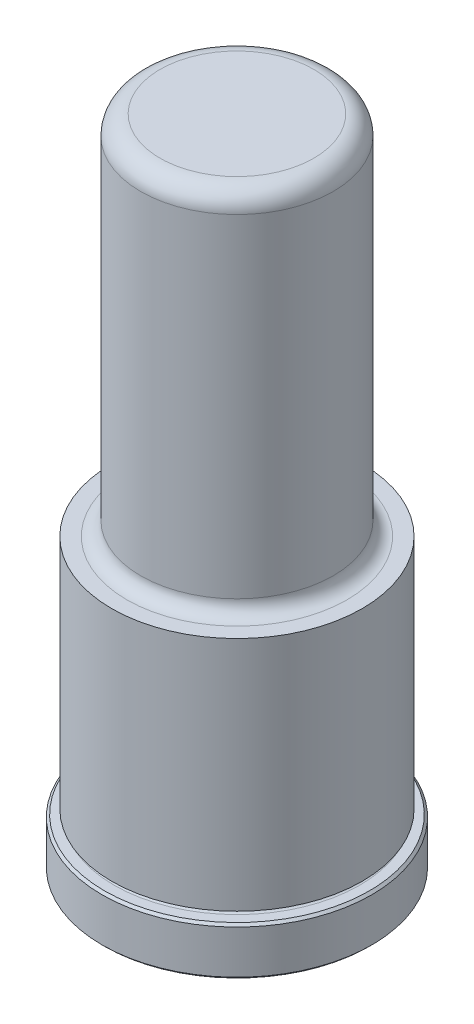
from build123d import *

# Parameters (mm, degrees)
CHAMFER1_SIZE = 0.381
FILLET7_R     = 3.175


with BuildPart() as part:
    # Sketch1 → Revolve1 (revolve)
    with BuildSketch(Plane(origin=(0, 0, 0), x_dir=(0, 0, -1), z_dir=(1, 0, 0)), mode=Mode.PRIVATE) as revolve1_sk:
        with BuildLine():
            Line((0, 0), (22.225, 0))
            Line((22.225, 0), (22.225, 7.9248))
            Line((22.225, 7.9248), (20.2438, 7.9248))
            ThreePointArc((20.2438, 7.9248), (19.8628, 8.3058), (20.2438, 8.6868))
            Line((20.2438, 8.6868), (20.6502, 8.6868))
            Line((20.6502, 8.6868), (20.6502, 47.625))
            Line((20.6502, 47.625), (18.1483, 47.625))
            ThreePointArc((18.1483, 47.625), (16.531853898, 48.294553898), (15.8623, 49.911))
            Line((15.8623, 49.911), (15.8623, 107.95))
            Line((15.8623, 107.95), (0, 107.95))
            Line((0, 107.95), (0, 0))
        make_face()
    revolve(revolve1_sk.sketch.rotate(Axis((0, 0, 0), (0, -1, 0)), 180), axis=Axis((0, 0, 0), (0, -1, 0)))

    # Chamfer1
    chamfer1_edges = [part.edges().sort_by_distance(p)[0] for p in [
        (0, 7.9248, -22.225),
        (0, 0, -22.225),
    ]]
    chamfer(chamfer1_edges, length=CHAMFER1_SIZE)

    # Fillet7
    fillet7_edges = [part.edges().sort_by_distance(p)[0] for p in [
        (0, 107.95, -15.8623),
    ]]
    fillet(fillet7_edges, radius=FILLET7_R)


solid = part.part
